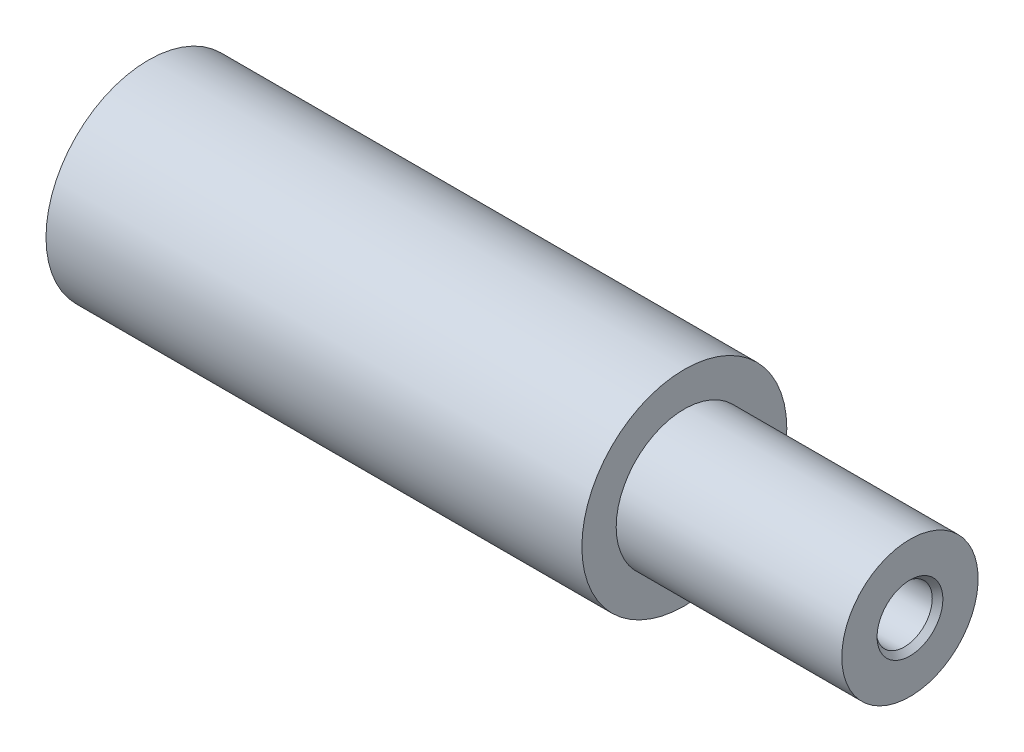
ISO-10303-21;
HEADER;
FILE_DESCRIPTION(('STEP AP214'),'2;1');
FILE_NAME('part.step','',(''),(''),'','','');
FILE_SCHEMA(('AUTOMOTIVE_DESIGN { 1 0 10303 214 1 1 1 1 }'));
ENDSEC;
DATA;
#1=APPLICATION_CONTEXT('core data for automotive mechanical design processes');
#2=APPLICATION_PROTOCOL_DEFINITION('international standard','automotive_design',2000,#1);
#3=PRODUCT_CONTEXT('',#1,'mechanical');
#4=PRODUCT('Part','Part','',(#3));
#5=PRODUCT_RELATED_PRODUCT_CATEGORY('part','',(#4));
#6=PRODUCT_DEFINITION_FORMATION('','',#4);
#7=PRODUCT_DEFINITION_CONTEXT('part definition',#1,'design');
#8=PRODUCT_DEFINITION('design','',#6,#7);
#9=PRODUCT_DEFINITION_SHAPE('','',#8);
#10=(LENGTH_UNIT() NAMED_UNIT(*) SI_UNIT(.MILLI.,.METRE.));
#11=(NAMED_UNIT(*) PLANE_ANGLE_UNIT() SI_UNIT($,.RADIAN.));
#12=(NAMED_UNIT(*) SI_UNIT($,.STERADIAN.) SOLID_ANGLE_UNIT());
#13=UNCERTAINTY_MEASURE_WITH_UNIT(LENGTH_MEASURE(1.E-05),#10,'distance_accuracy_value','');
#14=(GEOMETRIC_REPRESENTATION_CONTEXT(3) GLOBAL_UNCERTAINTY_ASSIGNED_CONTEXT((#13)) GLOBAL_UNIT_ASSIGNED_CONTEXT((#10,
#11,#12)) REPRESENTATION_CONTEXT('',''));
#15=CARTESIAN_POINT('',(0.,0.,0.));
#16=DIRECTION('',(0.,0.,1.));
#17=DIRECTION('',(1.,0.,0.));
#18=AXIS2_PLACEMENT_3D('',#15,#16,#17);
#19=CARTESIAN_POINT('',(20.574,0.,0.));
#20=DIRECTION('',(-1.,0.,0.));
#21=DIRECTION('',(0.,0.,1.));
#22=AXIS2_PLACEMENT_3D('',#19,#20,#21);
#23=CYLINDRICAL_SURFACE('',#22,2.7686);
#24=CARTESIAN_POINT('',(0.,0.,0.));
#25=DIRECTION('',(1.,0.,0.));
#26=DIRECTION('',(0.,0.,-1.));
#27=AXIS2_PLACEMENT_3D('',#24,#25,#26);
#28=CIRCLE('',#27,2.7686);
#29=CARTESIAN_POINT('',(0.,0.,-2.7686));
#30=VERTEX_POINT('',#29);
#31=EDGE_CURVE('E11',#30,#30,#28,.T.);
#32=ORIENTED_EDGE('',*,*,#31,.T.);
#33=EDGE_LOOP('',(#32));
#34=FACE_BOUND('',#33,.T.);
#35=CARTESIAN_POINT('',(14.478,0.,0.));
#36=DIRECTION('',(-1.,0.,0.));
#37=DIRECTION('',(0.,0.,1.));
#38=AXIS2_PLACEMENT_3D('',#35,#36,#37);
#39=CIRCLE('',#38,2.7686);
#40=CARTESIAN_POINT('',(14.478,0.,2.7686));
#41=VERTEX_POINT('',#40);
#42=EDGE_CURVE('E65',#41,#41,#39,.T.);
#43=ORIENTED_EDGE('',*,*,#42,.T.);
#44=EDGE_LOOP('',(#43));
#45=FACE_BOUND('',#44,.T.);
#46=ADVANCED_FACE('F26',(#34,#45),#23,.T.);
#47=CARTESIAN_POINT('',(0.,0.,0.));
#48=DIRECTION('',(1.,0.,0.));
#49=DIRECTION('',(0.,0.,-1.));
#50=AXIS2_PLACEMENT_3D('',#47,#48,#49);
#51=PLANE('',#50);
#52=CARTESIAN_POINT('',(0.,0.,0.));
#53=DIRECTION('',(-1.,0.,0.));
#54=DIRECTION('',(0.,0.,1.));
#55=AXIS2_PLACEMENT_3D('',#52,#53,#54);
#56=CIRCLE('',#55,1.27);
#57=CARTESIAN_POINT('',(0.,0.,1.27));
#58=VERTEX_POINT('',#57);
#59=EDGE_CURVE('E56',#58,#58,#56,.T.);
#60=ORIENTED_EDGE('',*,*,#59,.F.);
#61=EDGE_LOOP('',(#60));
#62=FACE_BOUND('',#61,.T.);
#63=ORIENTED_EDGE('',*,*,#31,.F.);
#64=EDGE_LOOP('',(#63));
#65=FACE_BOUND('',#64,.T.);
#66=ADVANCED_FACE('F87',(#62,#65),#51,.F.);
#67=CARTESIAN_POINT('',(14.478,2.7686,0.));
#68=DIRECTION('',(1.,0.,0.));
#69=DIRECTION('',(0.,0.,-1.));
#70=AXIS2_PLACEMENT_3D('',#67,#68,#69);
#71=PLANE('',#70);
#72=CARTESIAN_POINT('',(14.478,0.,0.));
#73=DIRECTION('',(-1.,0.,0.));
#74=DIRECTION('',(0.,0.,1.));
#75=AXIS2_PLACEMENT_3D('',#72,#73,#74);
#76=CIRCLE('',#75,1.8415);
#77=CARTESIAN_POINT('',(14.478,0.,1.8415));
#78=VERTEX_POINT('',#77);
#79=EDGE_CURVE('E33',#78,#78,#76,.T.);
#80=ORIENTED_EDGE('',*,*,#79,.T.);
#81=EDGE_LOOP('',(#80));
#82=FACE_BOUND('',#81,.T.);
#83=ORIENTED_EDGE('',*,*,#42,.F.);
#84=EDGE_LOOP('',(#83));
#85=FACE_BOUND('',#84,.T.);
#86=ADVANCED_FACE('F73',(#82,#85),#71,.T.);
#87=CARTESIAN_POINT('',(0.,0.,0.));
#88=DIRECTION('',(-1.,0.,0.));
#89=DIRECTION('',(0.,0.,1.));
#90=AXIS2_PLACEMENT_3D('',#87,#88,#89);
#91=CYLINDRICAL_SURFACE('',#90,1.8415);
#92=CARTESIAN_POINT('',(20.574,0.,0.));
#93=DIRECTION('',(-1.,0.,0.));
#94=DIRECTION('',(0.,0.,1.));
#95=AXIS2_PLACEMENT_3D('',#92,#93,#94);
#96=CIRCLE('',#95,1.8415);
#97=CARTESIAN_POINT('',(20.574,0.,1.8415));
#98=VERTEX_POINT('',#97);
#99=EDGE_CURVE('E68',#98,#98,#96,.T.);
#100=ORIENTED_EDGE('',*,*,#99,.T.);
#101=EDGE_LOOP('',(#100));
#102=FACE_BOUND('',#101,.T.);
#103=ORIENTED_EDGE('',*,*,#79,.F.);
#104=EDGE_LOOP('',(#103));
#105=FACE_BOUND('',#104,.T.);
#106=ADVANCED_FACE('F76',(#102,#105),#91,.T.);
#107=CARTESIAN_POINT('',(20.574,0.,0.));
#108=DIRECTION('',(1.,0.,0.));
#109=DIRECTION('',(0.,0.,-1.));
#110=AXIS2_PLACEMENT_3D('',#107,#108,#109);
#111=PLANE('',#110);
#112=CARTESIAN_POINT('',(20.574,0.,0.));
#113=DIRECTION('',(1.,0.,0.));
#114=DIRECTION('',(0.,0.,-1.));
#115=AXIS2_PLACEMENT_3D('',#112,#113,#114);
#116=CIRCLE('',#115,0.889);
#117=CARTESIAN_POINT('',(20.574,0.,-0.889));
#118=VERTEX_POINT('',#117);
#119=EDGE_CURVE('E51',#118,#118,#116,.T.);
#120=ORIENTED_EDGE('',*,*,#119,.F.);
#121=EDGE_LOOP('',(#120));
#122=FACE_BOUND('',#121,.T.);
#123=ORIENTED_EDGE('',*,*,#99,.F.);
#124=EDGE_LOOP('',(#123));
#125=FACE_BOUND('',#124,.T.);
#126=ADVANCED_FACE('F78',(#122,#125),#111,.T.);
#127=CARTESIAN_POINT('',(11.684,0.,0.));
#128=DIRECTION('',(-1.,0.,0.));
#129=DIRECTION('',(0.,0.,1.));
#130=AXIS2_PLACEMENT_3D('',#127,#128,#129);
#131=CONICAL_SURFACE('',#130,0.793749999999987,1.02974425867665);
#132=CARTESIAN_POINT('',(12.1609331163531,0.,0.));
#133=VERTEX_POINT('',#132);
#134=VERTEX_LOOP('',#133);
#135=FACE_BOUND('',#134,.T.);
#136=CARTESIAN_POINT('',(11.684,0.,0.));
#137=DIRECTION('',(-1.,0.,0.));
#138=DIRECTION('',(0.,0.,1.));
#139=AXIS2_PLACEMENT_3D('',#136,#137,#138);
#140=CIRCLE('',#139,0.793749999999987);
#141=CARTESIAN_POINT('',(11.684,0.,0.793749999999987));
#142=VERTEX_POINT('',#141);
#143=EDGE_CURVE('E62',#142,#142,#140,.T.);
#144=ORIENTED_EDGE('',*,*,#143,.T.);
#145=EDGE_LOOP('',(#144));
#146=FACE_BOUND('',#145,.T.);
#147=ADVANCED_FACE('F85',(#135,#146),#131,.F.);
#148=CARTESIAN_POINT('',(0.,0.,0.));
#149=DIRECTION('',(-1.,0.,0.));
#150=DIRECTION('',(0.,0.,1.));
#151=AXIS2_PLACEMENT_3D('',#148,#149,#150);
#152=CYLINDRICAL_SURFACE('',#151,0.793749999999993);
#153=ORIENTED_EDGE('',*,*,#143,.F.);
#154=EDGE_LOOP('',(#153));
#155=FACE_BOUND('',#154,.T.);
#156=CARTESIAN_POINT('',(0.547862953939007,0.,0.));
#157=DIRECTION('',(-1.,0.,0.));
#158=DIRECTION('',(0.,0.,1.));
#159=AXIS2_PLACEMENT_3D('',#156,#157,#158);
#160=CIRCLE('',#159,0.793749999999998);
#161=CARTESIAN_POINT('',(0.547862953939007,0.,0.793749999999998));
#162=VERTEX_POINT('',#161);
#163=EDGE_CURVE('E59',#162,#162,#160,.T.);
#164=ORIENTED_EDGE('',*,*,#163,.T.);
#165=EDGE_LOOP('',(#164));
#166=FACE_BOUND('',#165,.T.);
#167=ADVANCED_FACE('F108',(#155,#166),#152,.F.);
#168=CARTESIAN_POINT('',(0.,0.,0.));
#169=DIRECTION('',(-1.,0.,0.));
#170=DIRECTION('',(0.,0.,1.));
#171=AXIS2_PLACEMENT_3D('',#168,#169,#170);
#172=CONICAL_SURFACE('',#171,1.27,0.715584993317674);
#173=ORIENTED_EDGE('',*,*,#163,.F.);
#174=EDGE_LOOP('',(#173));
#175=FACE_BOUND('',#174,.T.);
#176=ORIENTED_EDGE('',*,*,#59,.T.);
#177=EDGE_LOOP('',(#176));
#178=FACE_BOUND('',#177,.T.);
#179=ADVANCED_FACE('F105',(#175,#178),#172,.F.);
#180=CARTESIAN_POINT('',(20.574,0.,0.));
#181=DIRECTION('',(1.,0.,0.));
#182=DIRECTION('',(0.,0.,-1.));
#183=AXIS2_PLACEMENT_3D('',#180,#181,#182);
#184=CONICAL_SURFACE('',#183,0.889,0.715584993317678);
#185=CARTESIAN_POINT('',(20.4205983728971,0.,0.));
#186=DIRECTION('',(1.,0.,0.));
#187=DIRECTION('',(0.,0.,-1.));
#188=AXIS2_PLACEMENT_3D('',#185,#186,#187);
#189=CIRCLE('',#188,0.755649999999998);
#190=CARTESIAN_POINT('',(20.4205983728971,0.,-0.755649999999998));
#191=VERTEX_POINT('',#190);
#192=EDGE_CURVE('E48',#191,#191,#189,.T.);
#193=ORIENTED_EDGE('',*,*,#192,.F.);
#194=EDGE_LOOP('',(#193));
#195=FACE_BOUND('',#194,.T.);
#196=ORIENTED_EDGE('',*,*,#119,.T.);
#197=EDGE_LOOP('',(#196));
#198=FACE_BOUND('',#197,.T.);
#199=ADVANCED_FACE('F107',(#195,#198),#184,.F.);
#200=CARTESIAN_POINT('',(20.574,0.,0.));
#201=DIRECTION('',(1.,0.,0.));
#202=DIRECTION('',(0.,0.,-1.));
#203=AXIS2_PLACEMENT_3D('',#200,#201,#202);
#204=CYLINDRICAL_SURFACE('',#203,0.755649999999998);
#205=CARTESIAN_POINT('',(14.224,0.,0.));
#206=DIRECTION('',(1.,0.,0.));
#207=DIRECTION('',(0.,0.,-1.));
#208=AXIS2_PLACEMENT_3D('',#205,#206,#207);
#209=CIRCLE('',#208,0.755649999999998);
#210=CARTESIAN_POINT('',(14.224,0.,-0.755649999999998));
#211=VERTEX_POINT('',#210);
#212=EDGE_CURVE('E46',#211,#211,#209,.T.);
#213=ORIENTED_EDGE('',*,*,#212,.F.);
#214=EDGE_LOOP('',(#213));
#215=FACE_BOUND('',#214,.T.);
#216=ORIENTED_EDGE('',*,*,#192,.T.);
#217=EDGE_LOOP('',(#216));
#218=FACE_BOUND('',#217,.T.);
#219=ADVANCED_FACE('F42',(#215,#218),#204,.F.);
#220=CARTESIAN_POINT('',(14.224,0.,0.));
#221=DIRECTION('',(1.,0.,0.));
#222=DIRECTION('',(0.,0.,-1.));
#223=AXIS2_PLACEMENT_3D('',#220,#221,#222);
#224=CONICAL_SURFACE('',#223,0.755649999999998,1.02974425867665);
#225=CARTESIAN_POINT('',(13.7699596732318,0.,0.));
#226=VERTEX_POINT('',#225);
#227=VERTEX_LOOP('',#226);
#228=FACE_BOUND('',#227,.T.);
#229=ORIENTED_EDGE('',*,*,#212,.T.);
#230=EDGE_LOOP('',(#229));
#231=FACE_BOUND('',#230,.T.);
#232=ADVANCED_FACE('F39',(#228,#231),#224,.F.);
#233=CLOSED_SHELL('',(#46,#66,#86,#106,#126,#147,#167,#179,#199,#219,#232));
#234=MANIFOLD_SOLID_BREP('B2',#233);
#235=ADVANCED_BREP_SHAPE_REPRESENTATION('',(#18,#234),#14);
#236=SHAPE_DEFINITION_REPRESENTATION(#9,#235);
ENDSEC;
END-ISO-10303-21;
